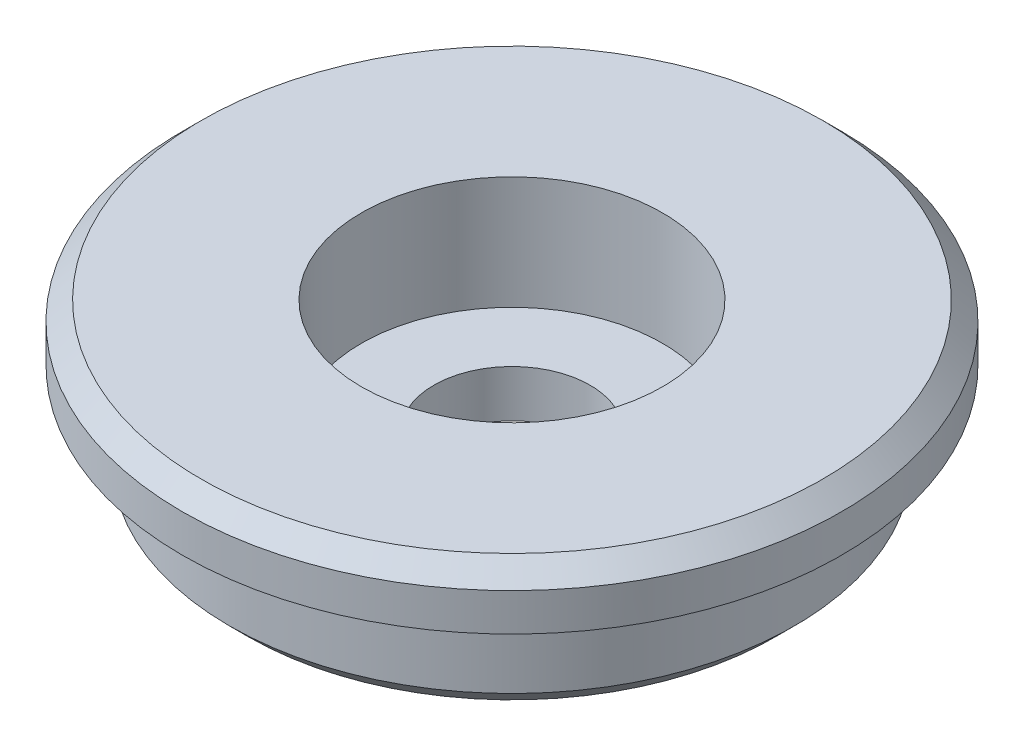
from build123d import *

# Parameters (mm, degrees)
CONG_1_R        = 0.5
CHANFREIN1_SIZE = 1


with BuildPart() as part:
    # Esquisse1 → R_volution1 (revolve)
    with BuildSketch(Plane.XY, mode=Mode.PRIVATE) as r_volution1_sk:
        Polygon((8, 2.5), (8, 8.5), (17.5, 8.5), (17.5, 5.5), (15, 5.5), (15, 0), (4.15, 0), (4.15, 2.5), align=None)
    revolve(r_volution1_sk.sketch.rotate(Axis((0, 34.144553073, 0), (0, -1, 0)), 90), axis=Axis((0, 34.144553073, 0), (0, -1, 0)))

    # Cong_1
    cong_1_edges = [part.edges().sort_by_distance(p)[0] for p in [
        (0, 5.5, -15),
    ]]
    fillet(cong_1_edges, radius=CONG_1_R)

    # Chanfrein1
    chanfrein1_edges = [part.edges().sort_by_distance(p)[0] for p in [
        (0, 0, -15),
        (0, 8.5, -17.5),
    ]]
    chamfer(chanfrein1_edges, length=CHANFREIN1_SIZE)


solid = part.part
